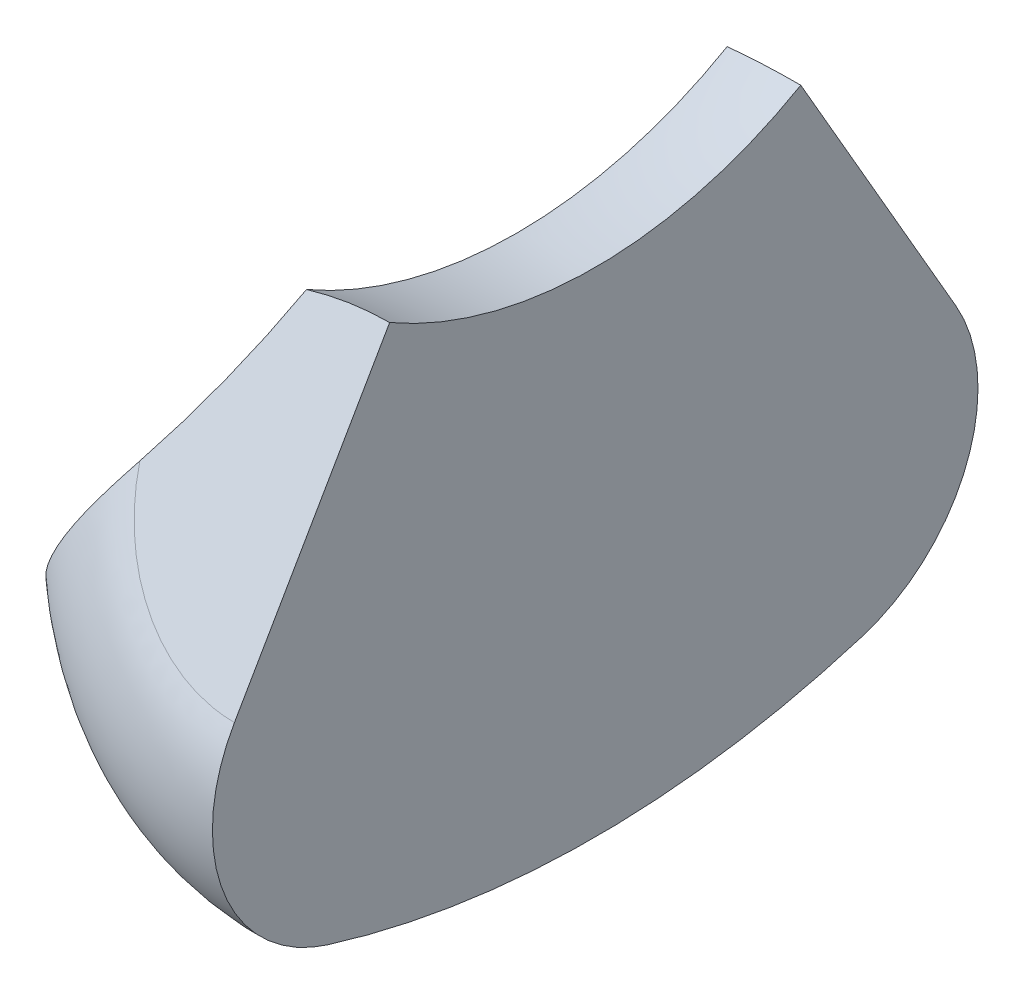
ISO-10303-21;
HEADER;
FILE_DESCRIPTION(('STEP AP214'),'2;1');
FILE_NAME('part.step','',(''),(''),'','','');
FILE_SCHEMA(('AUTOMOTIVE_DESIGN { 1 0 10303 214 1 1 1 1 }'));
ENDSEC;
DATA;
#1=APPLICATION_CONTEXT('core data for automotive mechanical design processes');
#2=APPLICATION_PROTOCOL_DEFINITION('international standard','automotive_design',2000,#1);
#3=PRODUCT_CONTEXT('',#1,'mechanical');
#4=PRODUCT('Part','Part','',(#3));
#5=PRODUCT_RELATED_PRODUCT_CATEGORY('part','',(#4));
#6=PRODUCT_DEFINITION_FORMATION('','',#4);
#7=PRODUCT_DEFINITION_CONTEXT('part definition',#1,'design');
#8=PRODUCT_DEFINITION('design','',#6,#7);
#9=PRODUCT_DEFINITION_SHAPE('','',#8);
#10=(LENGTH_UNIT() NAMED_UNIT(*) SI_UNIT(.MILLI.,.METRE.));
#11=(NAMED_UNIT(*) PLANE_ANGLE_UNIT() SI_UNIT($,.RADIAN.));
#12=(NAMED_UNIT(*) SI_UNIT($,.STERADIAN.) SOLID_ANGLE_UNIT());
#13=UNCERTAINTY_MEASURE_WITH_UNIT(LENGTH_MEASURE(1.E-05),#10,'distance_accuracy_value','');
#14=(GEOMETRIC_REPRESENTATION_CONTEXT(3) GLOBAL_UNCERTAINTY_ASSIGNED_CONTEXT((#13)) GLOBAL_UNIT_ASSIGNED_CONTEXT((#10,
#11,#12)) REPRESENTATION_CONTEXT('',''));
#15=CARTESIAN_POINT('',(0.,0.,0.));
#16=DIRECTION('',(0.,0.,1.));
#17=DIRECTION('',(1.,0.,0.));
#18=AXIS2_PLACEMENT_3D('',#15,#16,#17);
#19=CARTESIAN_POINT('',(14.2,0.,0.));
#20=DIRECTION('',(-1.,0.,0.));
#21=DIRECTION('',(0.,-1.,0.));
#22=AXIS2_PLACEMENT_3D('',#19,#20,#21);
#23=TOROIDAL_SURFACE('',#22,9.,4.);
#24=CARTESIAN_POINT('',(14.2,0.,0.));
#25=DIRECTION('',(-1.,0.,0.));
#26=DIRECTION('',(0.,-1.,0.));
#27=AXIS2_PLACEMENT_3D('',#24,#25,#26);
#28=CIRCLE('',#27,5.);
#29=CARTESIAN_POINT('',(14.2,-4.33012701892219,-2.50000000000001));
#30=VERTEX_POINT('',#29);
#31=CARTESIAN_POINT('',(14.2,-4.33012701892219,2.5));
#32=VERTEX_POINT('',#31);
#33=EDGE_CURVE('E131',#30,#32,#28,.T.);
#34=ORIENTED_EDGE('',*,*,#33,.F.);
#35=CARTESIAN_POINT('',(14.2,-7.79422863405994,-4.50000000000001));
#36=DIRECTION('',(0.,-0.500000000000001,0.866025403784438));
#37=DIRECTION('',(-1.,0.,0.));
#38=AXIS2_PLACEMENT_3D('',#35,#36,#37);
#39=CIRCLE('',#38,4.);
#40=CARTESIAN_POINT('',(13.2466613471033,-4.42995173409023,-2.55763382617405));
#41=VERTEX_POINT('',#40);
#42=EDGE_CURVE('E99',#30,#41,#39,.T.);
#43=ORIENTED_EDGE('',*,*,#42,.T.);
#44=CARTESIAN_POINT('',(13.2466613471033,0.,0.));
#45=DIRECTION('',(-1.,0.,0.));
#46=DIRECTION('',(0.,-1.,0.));
#47=AXIS2_PLACEMENT_3D('',#44,#45,#46);
#48=CIRCLE('',#47,5.11526765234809);
#49=CARTESIAN_POINT('',(13.2466613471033,-4.42995173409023,2.55763382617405));
#50=VERTEX_POINT('',#49);
#51=EDGE_CURVE('E94',#41,#50,#48,.T.);
#52=ORIENTED_EDGE('',*,*,#51,.T.);
#53=CARTESIAN_POINT('',(14.2,-7.79422863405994,4.50000000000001));
#54=DIRECTION('',(0.,0.500000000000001,0.866025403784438));
#55=DIRECTION('',(-1.,0.,0.));
#56=AXIS2_PLACEMENT_3D('',#53,#54,#55);
#57=CIRCLE('',#56,4.);
#58=EDGE_CURVE('E97',#32,#50,#57,.T.);
#59=ORIENTED_EDGE('',*,*,#58,.F.);
#60=EDGE_LOOP('',(#34,#43,#52,#59));
#61=FACE_BOUND('',#60,.T.);
#62=ADVANCED_FACE('F32',(#61),#23,.T.);
#63=CARTESIAN_POINT('',(14.2,-4.33012701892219,-2.50000000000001));
#64=DIRECTION('',(1.,0.,0.));
#65=DIRECTION('',(0.,1.,0.));
#66=AXIS2_PLACEMENT_3D('',#63,#64,#65);
#67=PLANE('',#66);
#68=CARTESIAN_POINT('',(14.2,0.,0.));
#69=DIRECTION('',(-1.,0.,0.));
#70=DIRECTION('',(0.,-1.,0.));
#71=AXIS2_PLACEMENT_3D('',#68,#69,#70);
#72=CIRCLE('',#71,11.);
#73=CARTESIAN_POINT('',(14.2,-10.5103069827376,-3.24552724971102));
#74=VERTEX_POINT('',#73);
#75=CARTESIAN_POINT('',(14.2,-10.5103069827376,3.24552724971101));
#76=VERTEX_POINT('',#75);
#77=EDGE_CURVE('E128',#74,#76,#72,.T.);
#78=ORIENTED_EDGE('',*,*,#77,.F.);
#79=CARTESIAN_POINT('',(14.1999999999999,-8.59934207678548,-2.65543138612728));
#80=DIRECTION('',(1.,0.,0.));
#81=DIRECTION('',(0.,1.,0.));
#82=AXIS2_PLACEMENT_3D('',#79,#80,#81);
#83=CIRCLE('',#82,2.);
#84=CARTESIAN_POINT('',(14.2,-7.59934207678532,-4.38748219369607));
#85=VERTEX_POINT('',#84);
#86=EDGE_CURVE('E191',#74,#85,#83,.T.);
#87=ORIENTED_EDGE('',*,*,#86,.T.);
#88=DIRECTION('',(0.,0.866025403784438,0.500000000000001));
#89=VECTOR('',#88,1.);
#90=CARTESIAN_POINT('',(14.2,-4.33012701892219,-2.50000000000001));
#91=LINE('',#90,#89);
#92=EDGE_CURVE('E101',#85,#30,#91,.T.);
#93=ORIENTED_EDGE('',*,*,#92,.T.);
#94=ORIENTED_EDGE('',*,*,#33,.T.);
#95=DIRECTION('',(0.,0.866025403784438,-0.500000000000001));
#96=VECTOR('',#95,1.);
#97=CARTESIAN_POINT('',(14.2,-4.33012701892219,2.5));
#98=LINE('',#97,#96);
#99=CARTESIAN_POINT('',(14.2,-7.59934207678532,4.38748219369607));
#100=VERTEX_POINT('',#99);
#101=EDGE_CURVE('E107',#100,#32,#98,.T.);
#102=ORIENTED_EDGE('',*,*,#101,.F.);
#103=CARTESIAN_POINT('',(14.2,-8.59934207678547,2.65543138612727));
#104=DIRECTION('',(1.,0.,0.));
#105=DIRECTION('',(0.,1.,0.));
#106=AXIS2_PLACEMENT_3D('',#103,#104,#105);
#107=CIRCLE('',#106,2.);
#108=EDGE_CURVE('E207',#100,#76,#107,.T.);
#109=ORIENTED_EDGE('',*,*,#108,.T.);
#110=EDGE_LOOP('',(#78,#87,#93,#94,#102,#109));
#111=FACE_BOUND('',#110,.T.);
#112=ADVANCED_FACE('F152',(#111),#67,.T.);
#113=CARTESIAN_POINT('',(14.2,0.,0.));
#114=DIRECTION('',(-1.,0.,0.));
#115=DIRECTION('',(0.,-1.,0.));
#116=AXIS2_PLACEMENT_3D('',#113,#114,#115);
#117=TOROIDAL_SURFACE('',#116,7.,4.);
#118=CARTESIAN_POINT('',(10.8407822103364,0.,0.));
#119=DIRECTION('',(-1.,0.,0.));
#120=DIRECTION('',(0.,-1.,0.));
#121=AXIS2_PLACEMENT_3D('',#118,#119,#120);
#122=CIRCLE('',#121,9.17155608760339);
#123=CARTESIAN_POINT('',(10.8407822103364,-8.83027431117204,-2.47864815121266));
#124=VERTEX_POINT('',#123);
#125=CARTESIAN_POINT('',(10.8407822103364,-8.83027431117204,2.47864815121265));
#126=VERTEX_POINT('',#125);
#127=EDGE_CURVE('E100',#124,#126,#122,.T.);
#128=ORIENTED_EDGE('',*,*,#127,.F.);
#129=CARTESIAN_POINT('',(12.2249032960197,-5.52454645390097,-3.18959838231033));
#130=CARTESIAN_POINT('',(10.3385819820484,-5.2762326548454,-3.04623434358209));
#131=CARTESIAN_POINT('',(10.2498065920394,-6.21748362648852,-1.3889514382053));
#132=CARTESIAN_POINT('',(12.2155894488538,-5.577622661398,-3.22024194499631));
#133=CARTESIAN_POINT('',(10.3037202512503,-5.3735018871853,-3.10239276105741));
#134=CARTESIAN_POINT('',(10.2311788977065,-6.32782190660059,-1.43150047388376));
#135=CARTESIAN_POINT('',(12.2088690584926,-5.63101476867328,-3.25106789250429));
#136=CARTESIAN_POINT('',(10.2737721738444,-5.47232193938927,-3.1594465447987));
#137=CARTESIAN_POINT('',(10.2177381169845,-6.43878325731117,-1.47481684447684));
#138=CARTESIAN_POINT('',(12.2006785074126,-5.73810593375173,-3.31289700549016));
#139=CARTESIAN_POINT('',(10.2238351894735,-5.67336435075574,-3.27551843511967));
#140=CARTESIAN_POINT('',(10.2013570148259,-6.66127031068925,-1.56265854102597));
#141=CARTESIAN_POINT('',(12.1992089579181,-5.79180502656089,-3.34390019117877));
#142=CARTESIAN_POINT('',(10.2039407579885,-5.77558965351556,-3.33453824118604));
#143=CARTESIAN_POINT('',(10.1984179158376,-6.77279607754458,-1.60718400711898));
#144=CARTESIAN_POINT('',(12.2027727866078,-5.95280526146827,-3.43685372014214));
#145=CARTESIAN_POINT('',(10.1599847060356,-6.08768426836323,-3.51472615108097));
#146=CARTESIAN_POINT('',(10.2055455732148,-7.10705143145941,-1.74202710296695));
#147=CARTESIAN_POINT('',(12.215769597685,-6.06006084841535,-3.49877776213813));
#148=CARTESIAN_POINT('',(10.1525545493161,-6.30038126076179,-3.6375268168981));
#149=CARTESIAN_POINT('',(10.2315391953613,-7.32956612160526,-1.83365283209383));
#150=CARTESIAN_POINT('',(12.2626663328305,-6.26954753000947,-3.61972495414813));
#151=CARTESIAN_POINT('',(10.1837650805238,-6.7267846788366,-3.88371094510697));
#152=CARTESIAN_POINT('',(10.3253326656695,-7.76384508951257,-2.01553667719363));
#153=CARTESIAN_POINT('',(12.296283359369,-6.37182674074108,-3.67877588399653));
#154=CARTESIAN_POINT('',(10.2224876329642,-6.94020337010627,-4.00692828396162));
#155=CARTESIAN_POINT('',(10.392566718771,-7.97571357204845,-2.10579664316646));
#156=CARTESIAN_POINT('',(12.3835233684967,-6.56976705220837,-3.79305677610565));
#157=CARTESIAN_POINT('',(10.3474640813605,-7.36304315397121,-4.25105494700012));
#158=CARTESIAN_POINT('',(10.5670467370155,-8.38545025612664,-2.28270066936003));
#159=CARTESIAN_POINT('',(12.4371374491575,-6.66543107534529,-3.84828842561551));
#160=CARTESIAN_POINT('',(10.4342693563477,-7.57201990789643,-4.37170773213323));
#161=CARTESIAN_POINT('',(10.6742748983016,-8.58332464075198,-2.36934631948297));
#162=CARTESIAN_POINT('',(12.5610446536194,-6.84415409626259,-3.9514742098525));
#163=CARTESIAN_POINT('',(10.6521539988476,-7.9705265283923,-4.60178563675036));
#164=CARTESIAN_POINT('',(10.9220893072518,-8.95276544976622,-2.53281833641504));
#165=CARTESIAN_POINT('',(12.6307547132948,-6.92751669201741,-3.99960362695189));
#166=CARTESIAN_POINT('',(10.782137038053,-8.16000250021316,-4.7111796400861));
#167=CARTESIAN_POINT('',(11.061509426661,-9.1249673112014,-2.6098690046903));
#168=CARTESIAN_POINT('',(12.7858394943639,-7.08240487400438,-4.08902836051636));
#169=CARTESIAN_POINT('',(11.0848329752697,-8.51812215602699,-4.91794011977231));
#170=CARTESIAN_POINT('',(11.3716789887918,-9.44475225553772,-2.75406933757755));
#171=CARTESIAN_POINT('',(12.8711955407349,-7.1539443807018,-4.13033171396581));
#172=CARTESIAN_POINT('',(11.2576349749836,-8.68620641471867,-5.01498361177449));
#173=CARTESIAN_POINT('',(11.5423910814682,-9.59236429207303,-2.82123063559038));
#174=CARTESIAN_POINT('',(13.019487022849,-7.25789772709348,-4.19034920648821));
#175=CARTESIAN_POINT('',(11.5663860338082,-8.93346093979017,-5.15773607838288));
#176=CARTESIAN_POINT('',(11.838974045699,-9.80676977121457,-2.91933635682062));
#177=CARTESIAN_POINT('',(13.0783479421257,-7.29475083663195,-4.21162635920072));
#178=CARTESIAN_POINT('',(11.6910699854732,-9.02196595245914,-5.20883447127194));
#179=CARTESIAN_POINT('',(11.9566958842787,-9.8827570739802,-2.95424971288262));
#180=CARTESIAN_POINT('',(13.2003514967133,-7.36266324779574,-4.25083560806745));
#181=CARTESIAN_POINT('',(11.9530675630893,-9.18622931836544,-5.30367196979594));
#182=CARTESIAN_POINT('',(12.2007029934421,-10.0227548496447,-3.01876152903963));
#183=CARTESIAN_POINT('',(13.2634929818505,-7.39372409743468,-4.26876859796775));
#184=CARTESIAN_POINT('',(12.0903245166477,-9.26186665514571,-5.34734120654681));
#185=CARTESIAN_POINT('',(12.3269859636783,-10.0867685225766,-3.04836140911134));
#186=CARTESIAN_POINT('',(13.426866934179,-7.46405906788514,-4.30937651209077));
#187=CARTESIAN_POINT('',(12.4495711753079,-9.43430335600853,-5.44689758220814));
#188=CARTESIAN_POINT('',(12.6537338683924,-10.2316978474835,-3.11552549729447));
#189=CARTESIAN_POINT('',(13.5294502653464,-7.49932125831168,-4.32973514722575));
#190=CARTESIAN_POINT('',(12.678043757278,-9.52137936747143,-5.4971709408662));
#191=CARTESIAN_POINT('',(12.8589005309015,-10.3043324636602,-3.14933724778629));
#192=CARTESIAN_POINT('',(13.7401028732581,-7.55449077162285,-4.36158728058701));
#193=CARTESIAN_POINT('',(13.1520693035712,-9.6584238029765,-5.57629358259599));
#194=CARTESIAN_POINT('',(13.2802057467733,-10.41795751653,-3.20232097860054));
#195=CARTESIAN_POINT('',(13.8481800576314,-7.57437525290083,-4.37306759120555));
#196=CARTESIAN_POINT('',(13.3972296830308,-9.70806916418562,-5.60495634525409));
#197=CARTESIAN_POINT('',(13.4963601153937,-10.4589008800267,-3.22147118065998));
#198=CARTESIAN_POINT('',(14.0666721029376,-7.5980781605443,-4.38675247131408));
#199=CARTESIAN_POINT('',(13.895254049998,-9.76741190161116,-5.63921789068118));
#200=CARTESIAN_POINT('',(13.9333442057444,-10.5077054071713,-3.24430520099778));
#201=CARTESIAN_POINT('',(14.1770857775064,-7.60190455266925,-4.38896163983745));
#202=CARTESIAN_POINT('',(14.1476236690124,-9.77700994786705,-5.64475932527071));
#203=CARTESIAN_POINT('',(14.1541715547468,-10.5155829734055,-3.24799668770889));
#204=CARTESIAN_POINT('',(14.3419663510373,-7.59553813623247,-4.3852859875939));
#205=CARTESIAN_POINT('',(14.5244096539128,-9.76104506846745,-5.63554199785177));
#206=CARTESIAN_POINT('',(14.4839327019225,-10.502475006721,-3.2418607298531));
#207=CARTESIAN_POINT('',(14.3968271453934,-7.59139384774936,-4.38289328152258));
#208=CARTESIAN_POINT('',(14.6496449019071,-9.75065908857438,-5.6295456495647));
#209=CARTESIAN_POINT('',(14.5936542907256,-10.4939424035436,-3.2378655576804));
#210=CARTESIAN_POINT('',(14.5059509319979,-7.5791106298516,-4.37580156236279));
#211=CARTESIAN_POINT('',(14.8983271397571,-9.71991068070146,-5.61179304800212));
#212=CARTESIAN_POINT('',(14.811901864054,-10.4686510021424,-3.22603334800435));
#213=CARTESIAN_POINT('',(14.5602139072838,-7.57097158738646,-4.37110248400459));
#214=CARTESIAN_POINT('',(15.0217129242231,-9.69956337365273,-5.60004552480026));
#215=CARTESIAN_POINT('',(14.9204278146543,-10.4518919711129,-3.21819620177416));
#216=CARTESIAN_POINT('',(14.61400911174,-7.5608588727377,-4.3652639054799));
#217=CARTESIAN_POINT('',(15.143744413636,-9.67431330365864,-5.58546739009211));
#218=CARTESIAN_POINT('',(15.0280182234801,-10.4310675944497,-3.20846590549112));
#219=(BOUNDED_SURFACE() B_SPLINE_SURFACE(3,2,((#129,#130,#131),(#132,#133,#134),(#135,#136,
#137),(#138,#139,#140),(#141,#142,#143),(#144,#145,#146),(#147,#148,#149),(#150,#151,#152),
(#153,#154,#155),(#156,#157,#158),(#159,#160,#161),(#162,#163,#164),(#165,#166,#167),(#168,#169,
#170),(#171,#172,#173),(#174,#175,#176),(#177,#178,#179),(#180,#181,#182),(#183,#184,#185),
(#186,#187,#188),(#189,#190,#191),(#192,#193,#194),(#195,#196,#197),(#198,#199,#200),(#201,#202,
#203),(#204,#205,#206),(#207,#208,#209),(#210,#211,#212),(#213,#214,#215),(#216,#217,#218)),
.UNSPECIFIED.,.F.,.F.,.F.) B_SPLINE_SURFACE_WITH_KNOTS((4,2,2,2,2,2,2,2,2,2,2,2,2,2,4),(3,3),
(0.,0.185857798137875,0.371737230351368,0.7433180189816,1.10991154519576,1.47634207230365,
1.83114831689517,2.18553379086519,2.40303552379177,2.62047904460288,2.9499393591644,
3.27988810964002,3.60967316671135,3.77471069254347,3.93975288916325),(0.,1.),
.UNSPECIFIED.) GEOMETRIC_REPRESENTATION_ITEM() RATIONAL_B_SPLINE_SURFACE(((1.,0.723554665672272,
1.),(1.,0.72038971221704,1.),(1.,0.717264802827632,1.),(1.,0.71110910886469,1.),(1.,
0.70807833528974,1.),(1.,0.69915222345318,1.),(1.,0.693420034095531,1.),(1.,0.682586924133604,
1.),(1.,0.677478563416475,1.),(1.,0.667877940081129,1.),(1.,0.66338540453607,1.),(1.,
0.655203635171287,1.),(1.,0.6514934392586,1.),(1.,0.644740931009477,1.),(1.,0.641697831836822,
1.),(1.,0.637347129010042,1.),(1.,0.63582319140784,1.),(1.,0.633039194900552,1.),(1.,
0.631779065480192,1.),(1.,0.628944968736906,1.),(1.,0.627543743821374,1.),(1.,0.625363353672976,
1.),(1.,0.624585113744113,1.),(1.,0.623658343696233,1.),(1.,0.623509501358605,1.),(1.,
0.623758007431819,1.),(1.,0.623919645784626,1.),(1.,0.624400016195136,1.),(1.,0.624718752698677,
1.),(1.,0.625115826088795,1.))) REPRESENTATION_ITEM('') SURFACE());
#220=CARTESIAN_POINT('',(10.2498065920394,-6.21748362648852,-1.3889514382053));
#221=CARTESIAN_POINT('',(10.2311788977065,-6.32782190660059,-1.43150047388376));
#222=CARTESIAN_POINT('',(10.2177381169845,-6.43878325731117,-1.47481684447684));
#223=CARTESIAN_POINT('',(10.2013570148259,-6.66127031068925,-1.56265854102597));
#224=CARTESIAN_POINT('',(10.1984179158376,-6.77279607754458,-1.60718400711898));
#225=CARTESIAN_POINT('',(10.2055455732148,-7.10705143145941,-1.74202710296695));
#226=CARTESIAN_POINT('',(10.2315391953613,-7.32956612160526,-1.83365283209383));
#227=CARTESIAN_POINT('',(10.3253326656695,-7.76384508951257,-2.01553667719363));
#228=CARTESIAN_POINT('',(10.392566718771,-7.97571357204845,-2.10579664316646));
#229=CARTESIAN_POINT('',(10.5670467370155,-8.38545025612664,-2.28270066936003));
#230=CARTESIAN_POINT('',(10.6742748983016,-8.58332464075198,-2.36934631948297));
#231=CARTESIAN_POINT('',(10.9220893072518,-8.95276544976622,-2.53281833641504));
#232=CARTESIAN_POINT('',(11.061509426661,-9.1249673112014,-2.6098690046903));
#233=CARTESIAN_POINT('',(11.3716789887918,-9.44475225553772,-2.75406933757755));
#234=CARTESIAN_POINT('',(11.5423910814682,-9.59236429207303,-2.82123063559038));
#235=CARTESIAN_POINT('',(11.838974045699,-9.80676977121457,-2.91933635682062));
#236=CARTESIAN_POINT('',(11.9566958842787,-9.8827570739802,-2.95424971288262));
#237=CARTESIAN_POINT('',(12.2007029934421,-10.0227548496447,-3.01876152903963));
#238=CARTESIAN_POINT('',(12.3269859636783,-10.0867685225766,-3.04836140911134));
#239=CARTESIAN_POINT('',(12.6537338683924,-10.2316978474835,-3.11552549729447));
#240=CARTESIAN_POINT('',(12.8589005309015,-10.3043324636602,-3.14933724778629));
#241=CARTESIAN_POINT('',(13.2802057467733,-10.41795751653,-3.20232097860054));
#242=CARTESIAN_POINT('',(13.4963601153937,-10.4589008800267,-3.22147118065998));
#243=CARTESIAN_POINT('',(13.9333442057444,-10.5077054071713,-3.24430520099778));
#244=CARTESIAN_POINT('',(14.1541715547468,-10.5155829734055,-3.24799668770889));
#245=CARTESIAN_POINT('',(14.4839327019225,-10.502475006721,-3.2418607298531));
#246=CARTESIAN_POINT('',(14.5936542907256,-10.4939424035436,-3.2378655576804));
#247=CARTESIAN_POINT('',(14.811901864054,-10.4686510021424,-3.22603334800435));
#248=CARTESIAN_POINT('',(14.9204278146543,-10.4518919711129,-3.21819620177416));
#249=CARTESIAN_POINT('',(15.0280182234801,-10.4310675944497,-3.20846590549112));
#250=B_SPLINE_CURVE_WITH_KNOTS('',3,(#220,#221,#222,#223,#224,#225,#226,#227,#228,#229,#230,
#231,#232,#233,#234,#235,#236,#237,#238,#239,#240,#241,#242,#243,#244,#245,#246,#247,#248,#249),
.UNSPECIFIED.,.F.,.F.,(4,2,2,2,2,2,2,2,2,2,2,2,2,2,4),(0.,0.185857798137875,0.371737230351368,
0.7433180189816,1.10991154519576,1.47634207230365,1.83114831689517,2.18553379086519,
2.40303552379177,2.62047904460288,2.9499393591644,3.27988810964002,3.60967316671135,
3.77471069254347,3.93975288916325),.UNSPECIFIED.);
#251=EDGE_CURVE('E140',#124,#74,#250,.T.);
#252=ORIENTED_EDGE('',*,*,#251,.T.);
#253=ORIENTED_EDGE('',*,*,#77,.T.);
#254=CARTESIAN_POINT('',(14.9849356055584,-7.45674109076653,4.30515147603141));
#255=CARTESIAN_POINT('',(15.9761446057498,-9.41629966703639,5.43650314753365));
#256=CARTESIAN_POINT('',(15.7698712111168,-10.2166128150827,3.10857019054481));
#257=CARTESIAN_POINT('',(14.9336646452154,-7.47619167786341,4.31638127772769));
#258=CARTESIAN_POINT('',(15.8624423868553,-9.46422563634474,5.46417321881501));
#259=CARTESIAN_POINT('',(15.6673292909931,-10.2566852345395,3.12718081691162));
#260=CARTESIAN_POINT('',(14.8814604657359,-7.49373855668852,4.3265119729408));
#261=CARTESIAN_POINT('',(15.7460695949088,-9.50757159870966,5.48919902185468));
#262=CARTESIAN_POINT('',(15.5629209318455,-10.2928305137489,3.14399771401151));
#263=CARTESIAN_POINT('',(14.7755119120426,-7.52490950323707,4.3445085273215));
#264=CARTESIAN_POINT('',(15.5085832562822,-9.58482162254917,5.53379934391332));
#265=CARTESIAN_POINT('',(15.3510238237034,-10.3570341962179,3.17390545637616));
#266=CARTESIAN_POINT('',(14.7217674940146,-7.53853345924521,4.35237432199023));
#267=CARTESIAN_POINT('',(15.3875212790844,-9.61868690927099,5.55335147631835));
#268=CARTESIAN_POINT('',(15.2435349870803,-10.3850923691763,3.18699619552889));
#269=CARTESIAN_POINT('',(14.5587752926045,-7.57333405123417,4.37246645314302));
#270=CARTESIAN_POINT('',(15.0186030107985,-9.70546326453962,5.60345182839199));
#271=CARTESIAN_POINT('',(14.9175505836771,-10.456758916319,3.22045801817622));
#272=CARTESIAN_POINT('',(14.4477135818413,-7.58846024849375,4.38119956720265));
#273=CARTESIAN_POINT('',(14.7657819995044,-9.74331090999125,5.62530317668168));
#274=CARTESIAN_POINT('',(14.6954271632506,-10.4879022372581,3.23503870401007));
#275=CARTESIAN_POINT('',(14.2260716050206,-7.60189170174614,4.38895422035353));
#276=CARTESIAN_POINT('',(14.2596165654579,-9.77697766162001,5.64474068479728));
#277=CARTESIAN_POINT('',(14.2521432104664,-10.5155565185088,3.2479843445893));
#278=CARTESIAN_POINT('',(14.1155111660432,-7.60045737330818,4.38812611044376));
#279=CARTESIAN_POINT('',(14.0068483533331,-9.77337920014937,5.64266311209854));
#280=CARTESIAN_POINT('',(14.0310223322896,-10.5126036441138,3.24660034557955));
#281=CARTESIAN_POINT('',(13.896403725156,-7.58146466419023,4.37716066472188));
#282=CARTESIAN_POINT('',(13.5069202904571,-9.7257992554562,5.61519281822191));
#283=CARTESIAN_POINT('',(13.5928074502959,-10.4734983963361,3.22829882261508));
#284=CARTESIAN_POINT('',(13.7878532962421,-7.56393693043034,4.36704102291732));
#285=CARTESIAN_POINT('',(13.2602480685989,-9.68199021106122,5.58989965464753));
#286=CARTESIAN_POINT('',(13.3757065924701,-10.4374091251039,3.21141082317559));
#287=CARTESIAN_POINT('',(13.6209488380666,-7.5241636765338,4.34407792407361));
#288=CARTESIAN_POINT('',(12.883437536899,-9.58296983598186,5.5327302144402));
#289=CARTESIAN_POINT('',(13.0418976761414,-10.3554978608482,3.17319064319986));
#290=CARTESIAN_POINT('',(13.5608845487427,-7.50709675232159,4.33422433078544));
#291=CARTESIAN_POINT('',(12.7486219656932,-9.54063661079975,5.50828911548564));
#292=CARTESIAN_POINT('',(12.9217690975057,-10.3203465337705,3.15680490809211));
#293=CARTESIAN_POINT('',(13.4429237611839,-7.46804251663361,4.31167635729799));
#294=CARTESIAN_POINT('',(12.4854980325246,-9.44412954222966,5.452570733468));
#295=CARTESIAN_POINT('',(12.6858475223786,-10.2398974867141,3.11937649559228));
#296=CARTESIAN_POINT('',(13.3850276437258,-7.44605434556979,4.29898148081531));
#297=CARTESIAN_POINT('',(12.3572599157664,-9.39001411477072,5.42132717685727));
#298=CARTESIAN_POINT('',(12.5700552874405,-10.1945979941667,3.09833300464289));
#299=CARTESIAN_POINT('',(13.227382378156,-7.37816412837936,4.25978504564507));
#300=CARTESIAN_POINT('',(12.0113581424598,-9.22392808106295,5.32543736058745));
#301=CARTESIAN_POINT('',(12.2547647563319,-10.054706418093,3.03350197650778));
#302=CARTESIAN_POINT('',(13.1305192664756,-7.32705312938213,4.23027609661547));
#303=CARTESIAN_POINT('',(11.8021510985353,-9.09989091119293,5.25382446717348));
#304=CARTESIAN_POINT('',(12.0610385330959,-9.94936268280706,2.98484125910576));
#305=CARTESIAN_POINT('',(12.9938442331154,-7.24037347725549,4.18023157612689));
#306=CARTESIAN_POINT('',(11.5125932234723,-8.89153976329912,5.13353287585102));
#307=CARTESIAN_POINT('',(11.7876884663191,-9.77062737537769,2.90278834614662));
#308=CARTESIAN_POINT('',(12.9496836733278,-7.20977668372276,4.16256650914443));
#309=CARTESIAN_POINT('',(11.4203356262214,-8.81857786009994,5.09140830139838));
#310=CARTESIAN_POINT('',(11.6993673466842,-9.70752402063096,2.87389447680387));
#311=CARTESIAN_POINT('',(12.8644577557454,-7.1454416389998,4.1254226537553));
#312=CARTESIAN_POINT('',(11.2446435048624,-8.66617087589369,5.00341608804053));
#313=CARTESIAN_POINT('',(11.5289155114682,-9.57480640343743,2.81332973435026));
#314=CARTESIAN_POINT('',(12.823394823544,-7.11170097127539,4.10594247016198));
#315=CARTESIAN_POINT('',(11.1612207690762,-8.5867847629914,4.95758249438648));
#316=CARTESIAN_POINT('',(11.446789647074,-9.50518713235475,2.78165672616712));
#317=CARTESIAN_POINT('',(12.7055342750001,-7.0063487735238,4.04511735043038));
#318=CARTESIAN_POINT('',(10.9261663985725,-8.34129144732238,4.81584686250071));
#319=CARTESIAN_POINT('',(11.2110685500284,-9.2877497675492,2.68311085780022));
#320=CARTESIAN_POINT('',(12.6337778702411,-6.93042413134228,4.00128223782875));
#321=CARTESIAN_POINT('',(10.7880007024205,-8.16665505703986,4.71502049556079));
#322=CARTESIAN_POINT('',(11.0675557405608,-9.13097505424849,2.6125372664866));
#323=CARTESIAN_POINT('',(12.505661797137,-6.76938337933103,3.90830531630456));
#324=CARTESIAN_POINT('',(10.5525437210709,-7.80253646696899,4.50479652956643));
#325=CARTESIAN_POINT('',(10.8113235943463,-8.79823749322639,2.46421684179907));
#326=CARTESIAN_POINT('',(12.4493057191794,-6.68426513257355,3.85916227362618));
#327=CARTESIAN_POINT('',(10.4550226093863,-7.61353369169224,4.39567572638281));
#328=CARTESIAN_POINT('',(10.6986114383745,-8.62227018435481,2.38646834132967));
#329=CARTESIAN_POINT('',(12.3767641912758,-6.5506711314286,3.78203174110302));
#330=CARTESIAN_POINT('',(10.338857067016,-7.32176111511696,4.22722075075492));
#331=CARTESIAN_POINT('',(10.5535283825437,-8.34589980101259,2.26580391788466));
#332=CARTESIAN_POINT('',(12.3544132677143,-6.50463712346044,3.75545399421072));
#333=CARTESIAN_POINT('',(10.3050689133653,-7.22256656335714,4.16995074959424));
#334=CARTESIAN_POINT('',(10.5088265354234,-8.25063647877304,2.22445179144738));
#335=CARTESIAN_POINT('',(12.3141641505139,-6.4111825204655,3.70149795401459));
#336=CARTESIAN_POINT('',(10.2482074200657,-7.0233338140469,4.05492366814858));
#337=CARTESIAN_POINT('',(10.4283283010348,-8.05717314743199,2.14102356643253));
#338=CARTESIAN_POINT('',(12.2962616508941,-6.36376331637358,3.67412046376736));
#339=CARTESIAN_POINT('',(10.2250637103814,-6.92334318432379,3.99719405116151));
#340=CARTESIAN_POINT('',(10.3925233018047,-7.95897608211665,2.09894821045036));
#341=CARTESIAN_POINT('',(12.2493068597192,-6.21976521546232,3.59098312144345));
#342=CARTESIAN_POINT('',(10.1715405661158,-6.62415370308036,3.82445692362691));
#343=CARTESIAN_POINT('',(10.2986137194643,-7.66067443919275,1.97205577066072));
#344=CARTESIAN_POINT('',(12.2270215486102,-6.12147227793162,3.53423366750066));
#345=CARTESIAN_POINT('',(10.1563090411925,-6.42391164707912,3.70884711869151));
#346=CARTESIAN_POINT('',(10.2540430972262,-7.45691412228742,1.88659629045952));
#347=CARTESIAN_POINT('',(12.200438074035,-5.91971747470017,3.41775047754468));
#348=CARTESIAN_POINT('',(10.1657669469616,-6.02282015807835,3.47727683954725));
#349=CARTESIAN_POINT('',(10.200876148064,-7.03838222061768,1.71408772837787));
#350=CARTESIAN_POINT('',(12.1967726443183,-5.81619314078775,3.35798067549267));
#351=CARTESIAN_POINT('',(10.1911702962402,-5.82224331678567,3.36147374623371));
#352=CARTESIAN_POINT('',(10.1935452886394,-6.82347114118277,1.62708240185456));
#353=CARTESIAN_POINT('',(12.2058691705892,-5.66166599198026,3.26876438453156));
#354=CARTESIAN_POINT('',(10.2582224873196,-5.52948000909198,3.19244677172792));
#355=CARTESIAN_POINT('',(10.2117383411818,-6.50247196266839,1.49984009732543));
#356=CARTESIAN_POINT('',(12.2113369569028,-5.61027085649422,3.23909138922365));
#357=CARTESIAN_POINT('',(10.285144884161,-5.43382180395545,3.13721848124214));
#358=CARTESIAN_POINT('',(10.2226739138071,-6.39567384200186,1.45796030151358));
#359=CARTESIAN_POINT('',(12.2270708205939,-5.50803642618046,3.18006631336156));
#360=CARTESIAN_POINT('',(10.347885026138,-5.24611471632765,3.02884574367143));
#361=CARTESIAN_POINT('',(10.2541416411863,-6.1831708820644,1.37557537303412));
#362=CARTESIAN_POINT('',(12.2373366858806,-5.4571971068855,3.1507142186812));
#363=CARTESIAN_POINT('',(10.3836220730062,-5.15405476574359,2.97569490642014));
#364=CARTESIAN_POINT('',(10.2746733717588,-6.07746599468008,1.33507017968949));
#365=CARTESIAN_POINT('',(12.2499663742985,-5.40678037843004,3.12160610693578));
#366=CARTESIAN_POINT('',(10.423693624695,-5.06363353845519,2.92349018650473));
#367=CARTESIAN_POINT('',(10.2999327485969,-5.97261261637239,1.29538941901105));
#368=(BOUNDED_SURFACE() B_SPLINE_SURFACE(3,2,((#254,#255,#256),(#257,#258,#259),(#260,#261,
#262),(#263,#264,#265),(#266,#267,#268),(#269,#270,#271),(#272,#273,#274),(#275,#276,#277),
(#278,#279,#280),(#281,#282,#283),(#284,#285,#286),(#287,#288,#289),(#290,#291,#292),(#293,#294,
#295),(#296,#297,#298),(#299,#300,#301),(#302,#303,#304),(#305,#306,#307),(#308,#309,#310),
(#311,#312,#313),(#314,#315,#316),(#317,#318,#319),(#320,#321,#322),(#323,#324,#325),(#326,#327,
#328),(#329,#330,#331),(#332,#333,#334),(#335,#336,#337),(#338,#339,#340),(#341,#342,#343),
(#344,#345,#346),(#347,#348,#349),(#350,#351,#352),(#353,#354,#355),(#356,#357,#358),(#359,#360,
#361),(#362,#363,#364),(#365,#366,#367)),.UNSPECIFIED.,.F.,.F.,
.F.) B_SPLINE_SURFACE_WITH_KNOTS((4,2,2,2,2,2,2,2,2,2,2,2,2,2,2,2,2,2,4),(3,3),(0.,
0.16781767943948,0.335640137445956,0.671107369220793,1.00130663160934,1.33087839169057,
1.52025468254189,1.70966407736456,2.04800521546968,2.21750649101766,2.38713914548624,
2.72534907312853,3.06363778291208,3.2364571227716,3.40910851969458,3.75451121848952,
4.11157627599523,4.29019737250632,4.46881057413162),(0.,1.),
.UNSPECIFIED.) GEOMETRIC_REPRESENTATION_ITEM() RATIONAL_B_SPLINE_SURFACE(((1.,0.629244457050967,
1.),(1.,0.628465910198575,1.),(1.,0.627767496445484,1.),(1.,0.626531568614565,1.),(1.,
0.625994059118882,1.),(1.,0.624624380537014,1.),(1.,0.624034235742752,1.),(1.,0.623510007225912,
1.),(1.,0.623565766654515,1.),(1.,0.624307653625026,1.),(1.,0.624992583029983,1.),(1.,
0.626561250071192,1.),(1.,0.627236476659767,1.),(1.,0.628791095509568,1.),(1.,0.629670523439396,
1.),(1.,0.632405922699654,1.),(1.,0.634486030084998,1.),(1.,0.638079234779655,1.),(1.,
0.639357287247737,1.),(1.,0.642070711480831,1.),(1.,0.643506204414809,1.),(1.,0.648036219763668,
1.),(1.,0.651361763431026,1.),(1.,0.658598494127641,1.),(1.,0.662509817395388,1.),(1.,
0.668825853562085,1.),(1.,0.671031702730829,1.),(1.,0.675576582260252,1.),(1.,0.67791548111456,
1.),(1.,0.685128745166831,1.),(1.,0.690198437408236,1.),(1.,0.700958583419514,1.),(1.,
0.706664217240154,1.),(1.,0.715489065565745,1.),(1.,0.718475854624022,1.),(1.,0.72452302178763,
1.),(1.,0.72758339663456,1.),(1.,0.730673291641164,1.))) REPRESENTATION_ITEM('') SURFACE());
#369=CARTESIAN_POINT('',(15.7698712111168,-10.2166128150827,3.10857019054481));
#370=CARTESIAN_POINT('',(15.6673292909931,-10.2566852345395,3.12718081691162));
#371=CARTESIAN_POINT('',(15.5629209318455,-10.2928305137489,3.14399771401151));
#372=CARTESIAN_POINT('',(15.3510238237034,-10.3570341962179,3.17390545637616));
#373=CARTESIAN_POINT('',(15.2435349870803,-10.3850923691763,3.18699619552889));
#374=CARTESIAN_POINT('',(14.9175505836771,-10.456758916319,3.22045801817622));
#375=CARTESIAN_POINT('',(14.6954271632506,-10.4879022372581,3.23503870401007));
#376=CARTESIAN_POINT('',(14.2521432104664,-10.5155565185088,3.2479843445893));
#377=CARTESIAN_POINT('',(14.0310223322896,-10.5126036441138,3.24660034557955));
#378=CARTESIAN_POINT('',(13.5928074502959,-10.4734983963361,3.22829882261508));
#379=CARTESIAN_POINT('',(13.3757065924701,-10.4374091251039,3.21141082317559));
#380=CARTESIAN_POINT('',(13.0418976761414,-10.3554978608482,3.17319064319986));
#381=CARTESIAN_POINT('',(12.9217690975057,-10.3203465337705,3.15680490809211));
#382=CARTESIAN_POINT('',(12.6858475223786,-10.2398974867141,3.11937649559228));
#383=CARTESIAN_POINT('',(12.5700552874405,-10.1945979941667,3.09833300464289));
#384=CARTESIAN_POINT('',(12.2547647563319,-10.054706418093,3.03350197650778));
#385=CARTESIAN_POINT('',(12.0610385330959,-9.94936268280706,2.98484125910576));
#386=CARTESIAN_POINT('',(11.7876884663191,-9.77062737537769,2.90278834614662));
#387=CARTESIAN_POINT('',(11.6993673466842,-9.70752402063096,2.87389447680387));
#388=CARTESIAN_POINT('',(11.5289155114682,-9.57480640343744,2.81332973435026));
#389=CARTESIAN_POINT('',(11.446789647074,-9.50518713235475,2.78165672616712));
#390=CARTESIAN_POINT('',(11.2110685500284,-9.2877497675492,2.68311085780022));
#391=CARTESIAN_POINT('',(11.0675557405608,-9.13097505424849,2.6125372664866));
#392=CARTESIAN_POINT('',(10.8113235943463,-8.79823749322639,2.46421684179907));
#393=CARTESIAN_POINT('',(10.6986114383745,-8.62227018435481,2.38646834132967));
#394=CARTESIAN_POINT('',(10.5535283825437,-8.34589980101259,2.26580391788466));
#395=CARTESIAN_POINT('',(10.5088265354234,-8.25063647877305,2.22445179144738));
#396=CARTESIAN_POINT('',(10.4283283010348,-8.05717314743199,2.14102356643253));
#397=CARTESIAN_POINT('',(10.3925233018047,-7.95897608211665,2.09894821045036));
#398=CARTESIAN_POINT('',(10.2986137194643,-7.66067443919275,1.97205577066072));
#399=CARTESIAN_POINT('',(10.2540430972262,-7.45691412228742,1.88659629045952));
#400=CARTESIAN_POINT('',(10.200876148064,-7.03838222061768,1.71408772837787));
#401=CARTESIAN_POINT('',(10.1935452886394,-6.82347114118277,1.62708240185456));
#402=CARTESIAN_POINT('',(10.2117383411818,-6.50247196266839,1.49984009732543));
#403=CARTESIAN_POINT('',(10.2226739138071,-6.39567384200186,1.45796030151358));
#404=CARTESIAN_POINT('',(10.2541416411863,-6.1831708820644,1.37557537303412));
#405=CARTESIAN_POINT('',(10.2746733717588,-6.07746599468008,1.33507017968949));
#406=CARTESIAN_POINT('',(10.2999327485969,-5.97261261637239,1.29538941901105));
#407=B_SPLINE_CURVE_WITH_KNOTS('',3,(#369,#370,#371,#372,#373,#374,#375,#376,#377,#378,#379,
#380,#381,#382,#383,#384,#385,#386,#387,#388,#389,#390,#391,#392,#393,#394,#395,#396,#397,#398,
#399,#400,#401,#402,#403,#404,#405,#406),.UNSPECIFIED.,.F.,.F.,(4,2,2,2,2,2,2,2,2,2,2,2,2,2,2,2,
2,2,4),(0.,0.16781767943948,0.335640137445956,0.671107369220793,1.00130663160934,
1.33087839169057,1.52025468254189,1.70966407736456,2.04800521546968,2.21750649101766,
2.38713914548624,2.72534907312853,3.06363778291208,3.2364571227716,3.40910851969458,
3.75451121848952,4.11157627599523,4.29019737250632,4.46881057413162),.UNSPECIFIED.);
#408=EDGE_CURVE('E133',#76,#126,#407,.T.);
#409=ORIENTED_EDGE('',*,*,#408,.T.);
#410=EDGE_LOOP('',(#128,#252,#253,#409));
#411=FACE_BOUND('',#410,.T.);
#412=ADVANCED_FACE('F148',(#411),#117,.T.);
#413=CARTESIAN_POINT('',(0.,0.,0.));
#414=DIRECTION('',(-1.,0.,0.));
#415=DIRECTION('',(0.,-0.866025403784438,-0.500000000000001));
#416=AXIS2_PLACEMENT_3D('',#413,#414,#415);
#417=SPHERICAL_SURFACE('',#416,14.2);
#418=CARTESIAN_POINT('',(0.,0.,0.));
#419=DIRECTION('',(0.,0.500000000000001,-0.866025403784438));
#420=DIRECTION('',(1.,0.,0.));
#421=AXIS2_PLACEMENT_3D('',#418,#419,#420);
#422=CIRCLE('',#421,14.2);
#423=CARTESIAN_POINT('',(12.2517727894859,-6.2169564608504,-3.58936148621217));
#424=VERTEX_POINT('',#423);
#425=EDGE_CURVE('E124',#41,#424,#422,.T.);
#426=ORIENTED_EDGE('',*,*,#425,.T.);
#427=CARTESIAN_POINT('',(12.2517727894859,-6.2169564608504,-3.58936148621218));
#428=CARTESIAN_POINT('',(12.2304116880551,-6.2485275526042,-3.60759173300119));
#429=CARTESIAN_POINT('',(12.2088874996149,-6.28033019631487,-3.62523146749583));
#430=CARTESIAN_POINT('',(12.1655304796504,-6.34446740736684,-3.65915139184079));
#431=CARTESIAN_POINT('',(12.1436975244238,-6.3768021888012,-3.6754310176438));
#432=CARTESIAN_POINT('',(12.0776386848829,-6.47489115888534,-3.72204548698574));
#433=CARTESIAN_POINT('',(12.0329989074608,-6.54151536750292,-3.75002898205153));
#434=CARTESIAN_POINT('',(11.9427613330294,-6.67751635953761,-3.79848884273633));
#435=CARTESIAN_POINT('',(11.8971592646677,-6.74690787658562,-3.81891665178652));
#436=CARTESIAN_POINT('',(11.8059358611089,-6.88756157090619,-3.85079810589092));
#437=CARTESIAN_POINT('',(11.7603146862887,-6.95882041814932,-3.86226673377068));
#438=CARTESIAN_POINT('',(11.6555702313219,-7.12505465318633,-3.8773385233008));
#439=CARTESIAN_POINT('',(11.5966543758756,-7.22052189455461,-3.87739226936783));
#440=CARTESIAN_POINT('',(11.4819164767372,-7.41115684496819,-3.8591150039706));
#441=CARTESIAN_POINT('',(11.4260844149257,-7.50632444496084,-3.84084773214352));
#442=CARTESIAN_POINT('',(11.3189513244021,-7.69442957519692,-3.78545063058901));
#443=CARTESIAN_POINT('',(11.267675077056,-7.78735311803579,-3.74822426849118));
#444=CARTESIAN_POINT('',(11.171852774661,-7.96746349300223,-3.65537913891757));
#445=CARTESIAN_POINT('',(11.1273122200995,-8.05464560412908,-3.59974545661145));
#446=CARTESIAN_POINT('',(11.0494241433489,-8.21454051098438,-3.47598794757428));
#447=CARTESIAN_POINT('',(11.0155251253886,-8.287832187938,-3.40895646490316));
#448=CARTESIAN_POINT('',(10.9561765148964,-8.42444686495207,-3.26217956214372));
#449=CARTESIAN_POINT('',(10.9307265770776,-8.48777027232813,-3.18243466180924));
#450=CARTESIAN_POINT('',(10.8895974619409,-8.60097612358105,-3.01500132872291));
#451=CARTESIAN_POINT('',(10.8736715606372,-8.65117705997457,-2.92758764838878));
#452=CARTESIAN_POINT('',(10.8509044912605,-8.73895166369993,-2.74570226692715));
#453=CARTESIAN_POINT('',(10.8440448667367,-8.77655086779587,-2.65124531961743));
#454=CARTESIAN_POINT('',(10.8410852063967,-8.81551963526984,-2.52946516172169));
#455=CARTESIAN_POINT('',(10.8407800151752,-8.82312905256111,-2.50411555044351));
#456=CARTESIAN_POINT('',(10.8407822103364,-8.83027431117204,-2.47864815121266));
#457=B_SPLINE_CURVE_WITH_KNOTS('',3,(#427,#428,#429,#430,#431,#432,#433,#434,#435,#436,#437,
#438,#439,#440,#441,#442,#443,#444,#445,#446,#447,#448,#449,#450,#451,#452,#453,#454,#455,#456),
.UNSPECIFIED.,.F.,.F.,(4,2,2,2,2,2,2,2,2,2,2,2,2,2,4),(0.,0.12675376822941,0.253559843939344,
0.508036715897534,0.764121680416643,1.01977746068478,1.35483986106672,1.688740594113,
2.02435867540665,2.36024936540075,2.67353837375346,2.98681457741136,3.29157758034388,
3.59571920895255,3.6750980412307),.UNSPECIFIED.);
#458=EDGE_CURVE('E45',#424,#124,#457,.T.);
#459=ORIENTED_EDGE('',*,*,#458,.T.);
#460=ORIENTED_EDGE('',*,*,#127,.T.);
#461=CARTESIAN_POINT('',(10.8407822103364,-8.83027431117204,2.47864815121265));
#462=CARTESIAN_POINT('',(10.8407829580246,-8.81643245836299,2.5279566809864));
#463=CARTESIAN_POINT('',(10.8419255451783,-8.80088383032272,2.57676385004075));
#464=CARTESIAN_POINT('',(10.8465080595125,-8.76644416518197,2.67307756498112));
#465=CARTESIAN_POINT('',(10.8499481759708,-8.74755285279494,2.72058400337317));
#466=CARTESIAN_POINT('',(10.8637238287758,-8.68602551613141,2.86057932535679));
#467=CARTESIAN_POINT('',(10.8775146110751,-8.63850197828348,2.95066591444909));
#468=CARTESIAN_POINT('',(10.9140566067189,-8.53166335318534,3.12163565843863));
#469=CARTESIAN_POINT('',(10.9368174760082,-8.47233559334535,3.20250877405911));
#470=CARTESIAN_POINT('',(10.9906636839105,-8.34361830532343,3.35258576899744));
#471=CARTESIAN_POINT('',(11.0217447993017,-8.27423388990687,3.42179553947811));
#472=CARTESIAN_POINT('',(11.0909787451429,-8.12809578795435,3.54606205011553));
#473=CARTESIAN_POINT('',(11.1290650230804,-8.05141448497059,3.60124122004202));
#474=CARTESIAN_POINT('',(11.2113244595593,-7.89234939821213,3.69693601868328));
#475=CARTESIAN_POINT('',(11.2554999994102,-7.80996338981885,3.73744588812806));
#476=CARTESIAN_POINT('',(11.3493774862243,-7.64034296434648,3.80361176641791));
#477=CARTESIAN_POINT('',(11.3991623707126,-7.55304905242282,3.82899643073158));
#478=CARTESIAN_POINT('',(11.5020342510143,-7.37734752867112,3.86375673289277));
#479=CARTESIAN_POINT('',(11.5551195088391,-7.28894052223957,3.87314072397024));
#480=CARTESIAN_POINT('',(11.666582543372,-7.10732299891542,3.87671052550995));
#481=CARTESIAN_POINT('',(11.7250810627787,-7.01416950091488,3.86987937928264));
#482=CARTESIAN_POINT('',(11.8425742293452,-6.83052881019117,3.84050016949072));
#483=CARTESIAN_POINT('',(11.9015696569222,-6.74004758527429,3.81791934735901));
#484=CARTESIAN_POINT('',(12.0099042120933,-6.5760979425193,3.76376581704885));
#485=CARTESIAN_POINT('',(12.0593784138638,-6.50209581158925,3.73402217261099));
#486=CARTESIAN_POINT('',(12.1324830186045,-6.3934252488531,3.68363190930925));
#487=CARTESIAN_POINT('',(12.1566041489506,-6.35768238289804,3.66592730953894));
#488=CARTESIAN_POINT('',(12.2044740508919,-6.28685087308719,3.62884120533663));
#489=CARTESIAN_POINT('',(12.228222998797,-6.25176191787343,3.60946052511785));
#490=CARTESIAN_POINT('',(12.2517727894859,-6.2169564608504,3.58936148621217));
#491=B_SPLINE_CURVE_WITH_KNOTS('',3,(#461,#462,#463,#464,#465,#466,#467,#468,#469,#470,#471,
#472,#473,#474,#475,#476,#477,#478,#479,#480,#481,#482,#483,#484,#485,#486,#487,#488,#489,#490),
.UNSPECIFIED.,.F.,.F.,(4,2,2,2,2,2,2,2,2,2,2,2,2,2,4),(0.,0.1535556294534,0.307123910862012,
0.613886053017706,0.920979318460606,1.2279170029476,1.53207658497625,1.83635545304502,
2.14594042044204,2.45536371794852,2.78470020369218,3.11472374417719,3.39582689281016,
3.53563761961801,3.67537998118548),.UNSPECIFIED.);
#492=CARTESIAN_POINT('',(12.2517727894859,-6.2169564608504,3.58936148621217));
#493=VERTEX_POINT('',#492);
#494=EDGE_CURVE('E52',#126,#493,#491,.T.);
#495=ORIENTED_EDGE('',*,*,#494,.T.);
#496=CARTESIAN_POINT('',(0.,0.,0.));
#497=DIRECTION('',(0.,-0.500000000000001,-0.866025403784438));
#498=DIRECTION('',(1.,0.,0.));
#499=AXIS2_PLACEMENT_3D('',#496,#497,#498);
#500=CIRCLE('',#499,14.2);
#501=EDGE_CURVE('E103',#50,#493,#500,.T.);
#502=ORIENTED_EDGE('',*,*,#501,.F.);
#503=ORIENTED_EDGE('',*,*,#51,.F.);
#504=EDGE_LOOP('',(#426,#459,#460,#495,#502,#503));
#505=FACE_BOUND('',#504,.T.);
#506=ADVANCED_FACE('F104',(#505),#417,.F.);
#507=CARTESIAN_POINT('',(14.2,-7.79422863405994,-4.50000000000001));
#508=DIRECTION('',(0.,0.500000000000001,-0.866025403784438));
#509=DIRECTION('',(-1.,0.,0.));
#510=AXIS2_PLACEMENT_3D('',#507,#508,#509);
#511=PLANE('',#510);
#512=ORIENTED_EDGE('',*,*,#92,.F.);
#513=CARTESIAN_POINT('',(14.61400911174,-7.5608588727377,-4.3652639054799));
#514=CARTESIAN_POINT('',(14.5602139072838,-7.57097158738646,-4.37110248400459));
#515=CARTESIAN_POINT('',(14.5059509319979,-7.5791106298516,-4.37580156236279));
#516=CARTESIAN_POINT('',(14.3968271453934,-7.59139384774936,-4.38289328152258));
#517=CARTESIAN_POINT('',(14.3419663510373,-7.59553813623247,-4.3852859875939));
#518=CARTESIAN_POINT('',(14.1770857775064,-7.60190455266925,-4.38896163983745));
#519=CARTESIAN_POINT('',(14.0666721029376,-7.5980781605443,-4.38675247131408));
#520=CARTESIAN_POINT('',(13.8481800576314,-7.57437525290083,-4.37306759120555));
#521=CARTESIAN_POINT('',(13.7401028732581,-7.55449077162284,-4.36158728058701));
#522=CARTESIAN_POINT('',(13.5294502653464,-7.49932125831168,-4.32973514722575));
#523=CARTESIAN_POINT('',(13.426866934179,-7.46405906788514,-4.30937651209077));
#524=CARTESIAN_POINT('',(13.2634929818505,-7.39372409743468,-4.26876859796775));
#525=CARTESIAN_POINT('',(13.2003514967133,-7.36266324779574,-4.25083560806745));
#526=CARTESIAN_POINT('',(13.0783479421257,-7.29475083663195,-4.21162635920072));
#527=CARTESIAN_POINT('',(13.019487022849,-7.25789772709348,-4.19034920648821));
#528=CARTESIAN_POINT('',(12.8711955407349,-7.1539443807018,-4.13033171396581));
#529=CARTESIAN_POINT('',(12.7858394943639,-7.08240487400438,-4.08902836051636));
#530=CARTESIAN_POINT('',(12.6307547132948,-6.92751669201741,-3.99960362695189));
#531=CARTESIAN_POINT('',(12.5610446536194,-6.84415409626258,-3.9514742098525));
#532=CARTESIAN_POINT('',(12.4371374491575,-6.66543107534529,-3.84828842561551));
#533=CARTESIAN_POINT('',(12.3835233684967,-6.56976705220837,-3.79305677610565));
#534=CARTESIAN_POINT('',(12.296283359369,-6.37182674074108,-3.67877588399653));
#535=CARTESIAN_POINT('',(12.2626663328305,-6.26954753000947,-3.61972495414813));
#536=CARTESIAN_POINT('',(12.215769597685,-6.06006084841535,-3.49877776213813));
#537=CARTESIAN_POINT('',(12.2027727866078,-5.95280526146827,-3.43685372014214));
#538=CARTESIAN_POINT('',(12.1992089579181,-5.79180502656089,-3.34390019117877));
#539=CARTESIAN_POINT('',(12.2006785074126,-5.73810593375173,-3.31289700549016));
#540=CARTESIAN_POINT('',(12.2088690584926,-5.63101476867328,-3.25106789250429));
#541=CARTESIAN_POINT('',(12.2155894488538,-5.577622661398,-3.22024194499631));
#542=CARTESIAN_POINT('',(12.2249032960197,-5.52454645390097,-3.18959838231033));
#543=B_SPLINE_CURVE_WITH_KNOTS('',3,(#513,#514,#515,#516,#517,#518,#519,#520,#521,#522,#523,
#524,#525,#526,#527,#528,#529,#530,#531,#532,#533,#534,#535,#536,#537,#538,#539,#540,#541,#542),
.UNSPECIFIED.,.F.,.F.,(4,2,2,2,2,2,2,2,2,2,2,2,2,2,4),(0.,0.165042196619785,0.3300797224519,
0.65986477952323,0.989813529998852,1.31927384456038,1.53671736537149,1.75421909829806,
2.10860457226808,2.46341081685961,2.82984134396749,3.19643487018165,3.56801565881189,
3.75389509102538,3.93975288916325),.UNSPECIFIED.);
#544=EDGE_CURVE('E60',#85,#424,#543,.T.);
#545=ORIENTED_EDGE('',*,*,#544,.T.);
#546=ORIENTED_EDGE('',*,*,#425,.F.);
#547=ORIENTED_EDGE('',*,*,#42,.F.);
#548=EDGE_LOOP('',(#512,#545,#546,#547));
#549=FACE_BOUND('',#548,.T.);
#550=ADVANCED_FACE('F154',(#549),#511,.T.);
#551=CARTESIAN_POINT('',(14.2,-7.79422863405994,4.50000000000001));
#552=DIRECTION('',(0.,-0.500000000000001,-0.866025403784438));
#553=DIRECTION('',(-1.,0.,0.));
#554=AXIS2_PLACEMENT_3D('',#551,#552,#553);
#555=PLANE('',#554);
#556=ORIENTED_EDGE('',*,*,#501,.T.);
#557=CARTESIAN_POINT('',(12.2499663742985,-5.40678037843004,3.12160610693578));
#558=CARTESIAN_POINT('',(12.2373366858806,-5.4571971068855,3.1507142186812));
#559=CARTESIAN_POINT('',(12.2270708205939,-5.50803642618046,3.18006631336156));
#560=CARTESIAN_POINT('',(12.2113369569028,-5.61027085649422,3.23909138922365));
#561=CARTESIAN_POINT('',(12.2058691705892,-5.66166599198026,3.26876438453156));
#562=CARTESIAN_POINT('',(12.1967726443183,-5.81619314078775,3.35798067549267));
#563=CARTESIAN_POINT('',(12.200438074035,-5.91971747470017,3.41775047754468));
#564=CARTESIAN_POINT('',(12.2270215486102,-6.12147227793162,3.53423366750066));
#565=CARTESIAN_POINT('',(12.2493068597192,-6.21976521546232,3.59098312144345));
#566=CARTESIAN_POINT('',(12.2962616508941,-6.36376331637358,3.67412046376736));
#567=CARTESIAN_POINT('',(12.3141641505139,-6.4111825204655,3.70149795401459));
#568=CARTESIAN_POINT('',(12.3544132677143,-6.50463712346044,3.75545399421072));
#569=CARTESIAN_POINT('',(12.3767641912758,-6.5506711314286,3.78203174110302));
#570=CARTESIAN_POINT('',(12.4493057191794,-6.68426513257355,3.85916227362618));
#571=CARTESIAN_POINT('',(12.505661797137,-6.76938337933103,3.90830531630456));
#572=CARTESIAN_POINT('',(12.6337778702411,-6.93042413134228,4.00128223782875));
#573=CARTESIAN_POINT('',(12.7055342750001,-7.0063487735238,4.04511735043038));
#574=CARTESIAN_POINT('',(12.823394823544,-7.11170097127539,4.10594247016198));
#575=CARTESIAN_POINT('',(12.8644577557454,-7.1454416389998,4.1254226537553));
#576=CARTESIAN_POINT('',(12.9496836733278,-7.20977668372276,4.16256650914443));
#577=CARTESIAN_POINT('',(12.9938442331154,-7.24037347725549,4.18023157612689));
#578=CARTESIAN_POINT('',(13.1305192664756,-7.32705312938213,4.23027609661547));
#579=CARTESIAN_POINT('',(13.227382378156,-7.37816412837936,4.25978504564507));
#580=CARTESIAN_POINT('',(13.3850276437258,-7.44605434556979,4.29898148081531));
#581=CARTESIAN_POINT('',(13.4429237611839,-7.4680425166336,4.31167635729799));
#582=CARTESIAN_POINT('',(13.5608845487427,-7.50709675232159,4.33422433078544));
#583=CARTESIAN_POINT('',(13.6209488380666,-7.5241636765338,4.34407792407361));
#584=CARTESIAN_POINT('',(13.7878532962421,-7.56393693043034,4.36704102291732));
#585=CARTESIAN_POINT('',(13.896403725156,-7.58146466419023,4.37716066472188));
#586=CARTESIAN_POINT('',(14.1155111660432,-7.60045737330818,4.38812611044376));
#587=CARTESIAN_POINT('',(14.2260716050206,-7.60189170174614,4.38895422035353));
#588=CARTESIAN_POINT('',(14.4477135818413,-7.58846024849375,4.38119956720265));
#589=CARTESIAN_POINT('',(14.5587752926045,-7.57333405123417,4.37246645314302));
#590=CARTESIAN_POINT('',(14.7217674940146,-7.53853345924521,4.35237432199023));
#591=CARTESIAN_POINT('',(14.7755119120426,-7.52490950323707,4.3445085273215));
#592=CARTESIAN_POINT('',(14.8814604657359,-7.49373855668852,4.3265119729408));
#593=CARTESIAN_POINT('',(14.9336646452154,-7.47619167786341,4.31638127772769));
#594=CARTESIAN_POINT('',(14.9849356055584,-7.45674109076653,4.30515147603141));
#595=B_SPLINE_CURVE_WITH_KNOTS('',3,(#557,#558,#559,#560,#561,#562,#563,#564,#565,#566,#567,
#568,#569,#570,#571,#572,#573,#574,#575,#576,#577,#578,#579,#580,#581,#582,#583,#584,#585,#586,
#587,#588,#589,#590,#591,#592,#593,#594),.UNSPECIFIED.,.F.,.F.,(4,2,2,2,2,2,2,2,2,2,2,2,2,2,2,2,
2,2,4),(0.,0.178613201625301,0.357234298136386,0.714299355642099,1.05970205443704,
1.23235345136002,1.40517279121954,1.74346150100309,2.08167142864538,2.25130408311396,
2.42080535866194,2.75914649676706,2.94855589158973,3.13793218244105,3.46750394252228,
3.79770320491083,4.13317043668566,4.30099289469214,4.46881057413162),.UNSPECIFIED.);
#596=EDGE_CURVE('E11',#493,#100,#595,.T.);
#597=ORIENTED_EDGE('',*,*,#596,.T.);
#598=ORIENTED_EDGE('',*,*,#101,.T.);
#599=ORIENTED_EDGE('',*,*,#58,.T.);
#600=EDGE_LOOP('',(#556,#597,#598,#599));
#601=FACE_BOUND('',#600,.T.);
#602=ADVANCED_FACE('F109',(#601),#555,.F.);
#603=ORIENTED_EDGE('',*,*,#458,.F.);
#604=ORIENTED_EDGE('',*,*,#544,.F.);
#605=ORIENTED_EDGE('',*,*,#86,.F.);
#606=ORIENTED_EDGE('',*,*,#251,.F.);
#607=EDGE_LOOP('',(#603,#604,#605,#606));
#608=FACE_BOUND('',#607,.T.);
#609=ADVANCED_FACE('F160',(#608),#219,.T.);
#610=ORIENTED_EDGE('',*,*,#494,.F.);
#611=ORIENTED_EDGE('',*,*,#408,.F.);
#612=ORIENTED_EDGE('',*,*,#108,.F.);
#613=ORIENTED_EDGE('',*,*,#596,.F.);
#614=EDGE_LOOP('',(#610,#611,#612,#613));
#615=FACE_BOUND('',#614,.T.);
#616=ADVANCED_FACE('F165',(#615),#368,.T.);
#617=CLOSED_SHELL('',(#62,#112,#412,#506,#550,#602,#609,#616));
#618=MANIFOLD_SOLID_BREP('B2',#617);
#619=ADVANCED_BREP_SHAPE_REPRESENTATION('',(#18,#618),#14);
#620=SHAPE_DEFINITION_REPRESENTATION(#9,#619);
ENDSEC;
END-ISO-10303-21;
